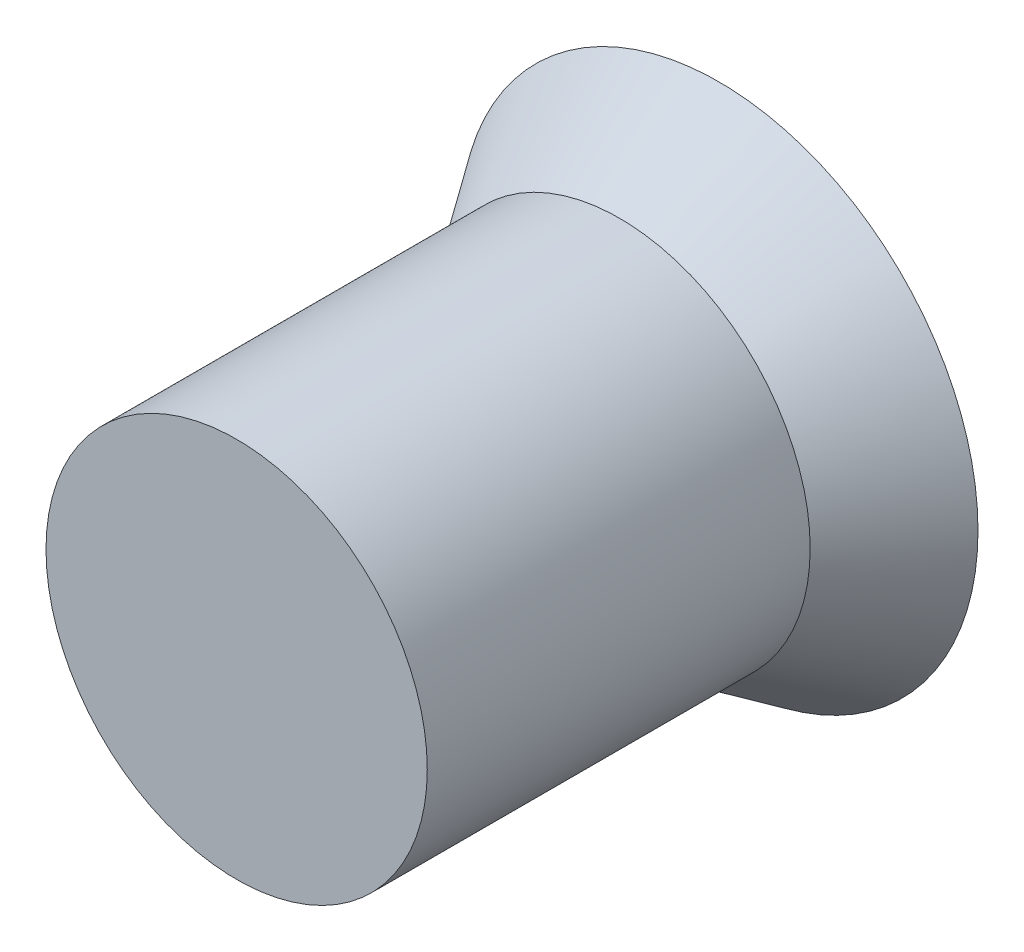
from build123d import *

# Parameters (mm, degrees)
SKETCH1_R           = 1.17
BOSS_EXTRUDE1_DEPTH = 2.35
SKETCH2_R           = 1.59


with BuildPart() as part:
    # Sketch1 → Boss-Extrude1 (new body)
    with BuildSketch(Plane.XY):
        Circle(SKETCH1_R)
    extrude(amount=-BOSS_EXTRUDE1_DEPTH)

    # Sketch2 → section 1 of loft1
    with BuildSketch(Plane(origin=(0, 0, -2.96), x_dir=(-1, 0, 0), z_dir=(0, 0, -1)), mode=Mode.PRIVATE) as loft1_s1:
        Circle(SKETCH2_R)
    # loft up to a face of the part (loft1)
    loft([Face(Wire([part.edges().sort_by_distance((-0.800920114, -0.852893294, -2.35))[0]])), loft1_s1.sketch])


solid = part.part
